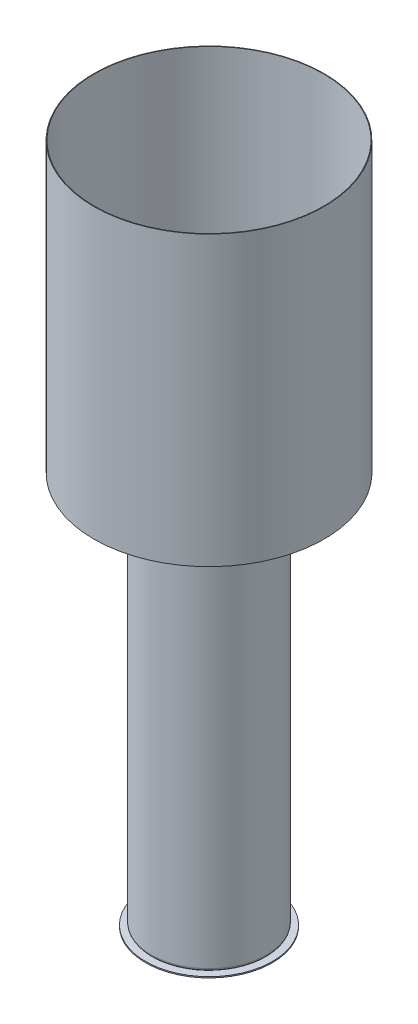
ISO-10303-21;
HEADER;
FILE_DESCRIPTION(('STEP AP214'),'2;1');
FILE_NAME('part.step','',(''),(''),'','','');
FILE_SCHEMA(('AUTOMOTIVE_DESIGN { 1 0 10303 214 1 1 1 1 }'));
ENDSEC;
DATA;
#1=APPLICATION_CONTEXT('core data for automotive mechanical design processes');
#2=APPLICATION_PROTOCOL_DEFINITION('international standard','automotive_design',2000,#1);
#3=PRODUCT_CONTEXT('',#1,'mechanical');
#4=PRODUCT('Part','Part','',(#3));
#5=PRODUCT_RELATED_PRODUCT_CATEGORY('part','',(#4));
#6=PRODUCT_DEFINITION_FORMATION('','',#4);
#7=PRODUCT_DEFINITION_CONTEXT('part definition',#1,'design');
#8=PRODUCT_DEFINITION('design','',#6,#7);
#9=PRODUCT_DEFINITION_SHAPE('','',#8);
#10=(LENGTH_UNIT() NAMED_UNIT(*) SI_UNIT(.MILLI.,.METRE.));
#11=(NAMED_UNIT(*) PLANE_ANGLE_UNIT() SI_UNIT($,.RADIAN.));
#12=(NAMED_UNIT(*) SI_UNIT($,.STERADIAN.) SOLID_ANGLE_UNIT());
#13=UNCERTAINTY_MEASURE_WITH_UNIT(LENGTH_MEASURE(1.E-05),#10,'distance_accuracy_value','');
#14=(GEOMETRIC_REPRESENTATION_CONTEXT(3) GLOBAL_UNCERTAINTY_ASSIGNED_CONTEXT((#13)) GLOBAL_UNIT_ASSIGNED_CONTEXT((#10,
#11,#12)) REPRESENTATION_CONTEXT('',''));
#15=CARTESIAN_POINT('',(0.,0.,0.));
#16=DIRECTION('',(0.,0.,1.));
#17=DIRECTION('',(1.,0.,0.));
#18=AXIS2_PLACEMENT_3D('',#15,#16,#17);
#19=CARTESIAN_POINT('',(0.,-2.,0.));
#20=DIRECTION('',(0.,1.,0.));
#21=DIRECTION('',(0.,0.,1.));
#22=AXIS2_PLACEMENT_3D('',#19,#20,#21);
#23=CYLINDRICAL_SURFACE('',#22,110.);
#24=CARTESIAN_POINT('',(0.,-2.,0.));
#25=DIRECTION('',(0.,-1.,0.));
#26=DIRECTION('',(0.,0.,-1.));
#27=AXIS2_PLACEMENT_3D('',#24,#25,#26);
#28=CIRCLE('',#27,110.);
#29=CARTESIAN_POINT('',(0.,-2.,-110.));
#30=VERTEX_POINT('',#29);
#31=EDGE_CURVE('E11',#30,#30,#28,.T.);
#32=ORIENTED_EDGE('',*,*,#31,.F.);
#33=EDGE_LOOP('',(#32));
#34=FACE_BOUND('',#33,.T.);
#35=CARTESIAN_POINT('',(0.,0.,0.));
#36=DIRECTION('',(0.,-1.,0.));
#37=DIRECTION('',(0.,0.,-1.));
#38=AXIS2_PLACEMENT_3D('',#35,#36,#37);
#39=CIRCLE('',#38,110.);
#40=CARTESIAN_POINT('',(0.,0.,-110.));
#41=VERTEX_POINT('',#40);
#42=EDGE_CURVE('E43',#41,#41,#39,.T.);
#43=ORIENTED_EDGE('',*,*,#42,.T.);
#44=EDGE_LOOP('',(#43));
#45=FACE_BOUND('',#44,.T.);
#46=ADVANCED_FACE('F40',(#34,#45),#23,.T.);
#47=CARTESIAN_POINT('',(0.,-2.,0.));
#48=DIRECTION('',(0.,-1.,0.));
#49=DIRECTION('',(0.,0.,-1.));
#50=AXIS2_PLACEMENT_3D('',#47,#48,#49);
#51=PLANE('',#50);
#52=ORIENTED_EDGE('',*,*,#31,.T.);
#53=EDGE_LOOP('',(#52));
#54=FACE_BOUND('',#53,.T.);
#55=ADVANCED_FACE('F55',(#54),#51,.T.);
#56=CARTESIAN_POINT('',(0.,0.,0.));
#57=DIRECTION('',(0.,-1.,0.));
#58=DIRECTION('',(0.,0.,-1.));
#59=AXIS2_PLACEMENT_3D('',#56,#57,#58);
#60=PLANE('',#59);
#61=ORIENTED_EDGE('',*,*,#42,.F.);
#62=EDGE_LOOP('',(#61));
#63=FACE_BOUND('',#62,.T.);
#64=ADVANCED_FACE('F53',(#63),#60,.F.);
#65=CLOSED_SHELL('',(#46,#55,#64));
#66=MANIFOLD_SOLID_BREP('B2',#65);
#67=CARTESIAN_POINT('',(0.,680.,0.));
#68=DIRECTION('',(0.,1.,0.));
#69=DIRECTION('',(0.,0.,1.));
#70=AXIS2_PLACEMENT_3D('',#67,#68,#69);
#71=CYLINDRICAL_SURFACE('',#70,200.);
#72=CARTESIAN_POINT('',(0.,680.,0.));
#73=DIRECTION('',(0.,1.,0.));
#74=DIRECTION('',(0.,0.,1.));
#75=AXIS2_PLACEMENT_3D('',#72,#73,#74);
#76=CIRCLE('',#75,200.);
#77=CARTESIAN_POINT('',(0.,680.,200.));
#78=VERTEX_POINT('',#77);
#79=EDGE_CURVE('E39',#78,#78,#76,.T.);
#80=ORIENTED_EDGE('',*,*,#79,.T.);
#81=EDGE_LOOP('',(#80));
#82=FACE_BOUND('',#81,.T.);
#83=CARTESIAN_POINT('',(0.,1180.,0.));
#84=DIRECTION('',(0.,1.,0.));
#85=DIRECTION('',(0.,0.,1.));
#86=AXIS2_PLACEMENT_3D('',#83,#84,#85);
#87=CIRCLE('',#86,200.);
#88=CARTESIAN_POINT('',(0.,1180.,200.));
#89=VERTEX_POINT('',#88);
#90=EDGE_CURVE('E98',#89,#89,#87,.T.);
#91=ORIENTED_EDGE('',*,*,#90,.F.);
#92=EDGE_LOOP('',(#91));
#93=FACE_BOUND('',#92,.T.);
#94=ADVANCED_FACE('F88',(#82,#93),#71,.T.);
#95=CARTESIAN_POINT('',(0.,680.,0.));
#96=DIRECTION('',(0.,1.,0.));
#97=DIRECTION('',(0.,0.,1.));
#98=AXIS2_PLACEMENT_3D('',#95,#96,#97);
#99=PLANE('',#98);
#100=CARTESIAN_POINT('',(0.,680.,0.));
#101=DIRECTION('',(0.,1.,0.));
#102=DIRECTION('',(0.,0.,1.));
#103=AXIS2_PLACEMENT_3D('',#100,#101,#102);
#104=CIRCLE('',#103,199.);
#105=CARTESIAN_POINT('',(0.,680.,199.));
#106=VERTEX_POINT('',#105);
#107=EDGE_CURVE('E94',#106,#106,#104,.T.);
#108=ORIENTED_EDGE('',*,*,#107,.T.);
#109=EDGE_LOOP('',(#108));
#110=FACE_BOUND('',#109,.T.);
#111=ORIENTED_EDGE('',*,*,#79,.F.);
#112=EDGE_LOOP('',(#111));
#113=FACE_BOUND('',#112,.T.);
#114=ADVANCED_FACE('F117',(#110,#113),#99,.F.);
#115=CARTESIAN_POINT('',(0.,680.,0.));
#116=DIRECTION('',(0.,1.,0.));
#117=DIRECTION('',(0.,0.,1.));
#118=AXIS2_PLACEMENT_3D('',#115,#116,#117);
#119=CYLINDRICAL_SURFACE('',#118,199.);
#120=ORIENTED_EDGE('',*,*,#107,.F.);
#121=EDGE_LOOP('',(#120));
#122=FACE_BOUND('',#121,.T.);
#123=CARTESIAN_POINT('',(0.,1180.,0.));
#124=DIRECTION('',(0.,1.,0.));
#125=DIRECTION('',(0.,0.,1.));
#126=AXIS2_PLACEMENT_3D('',#123,#124,#125);
#127=CIRCLE('',#126,199.);
#128=CARTESIAN_POINT('',(0.,1180.,199.));
#129=VERTEX_POINT('',#128);
#130=EDGE_CURVE('E102',#129,#129,#127,.T.);
#131=ORIENTED_EDGE('',*,*,#130,.T.);
#132=EDGE_LOOP('',(#131));
#133=FACE_BOUND('',#132,.T.);
#134=ADVANCED_FACE('F108',(#122,#133),#119,.F.);
#135=CARTESIAN_POINT('',(0.,1180.,0.));
#136=DIRECTION('',(0.,1.,0.));
#137=DIRECTION('',(0.,0.,1.));
#138=AXIS2_PLACEMENT_3D('',#135,#136,#137);
#139=PLANE('',#138);
#140=ORIENTED_EDGE('',*,*,#90,.T.);
#141=EDGE_LOOP('',(#140));
#142=FACE_BOUND('',#141,.T.);
#143=ORIENTED_EDGE('',*,*,#130,.F.);
#144=EDGE_LOOP('',(#143));
#145=FACE_BOUND('',#144,.T.);
#146=ADVANCED_FACE('F110',(#142,#145),#139,.T.);
#147=CLOSED_SHELL('',(#94,#114,#134,#146));
#148=MANIFOLD_SOLID_BREP('B6',#147);
#149=CARTESIAN_POINT('',(0.,720.,0.));
#150=DIRECTION('',(0.,-1.,0.));
#151=DIRECTION('',(0.,0.,-1.));
#152=AXIS2_PLACEMENT_3D('',#149,#150,#151);
#153=CYLINDRICAL_SURFACE('',#152,10.);
#154=CARTESIAN_POINT('',(0.,720.,0.));
#155=DIRECTION('',(0.,1.,0.));
#156=DIRECTION('',(0.,0.,1.));
#157=AXIS2_PLACEMENT_3D('',#154,#155,#156);
#158=CIRCLE('',#157,10.);
#159=CARTESIAN_POINT('',(0.,720.,10.));
#160=VERTEX_POINT('',#159);
#161=EDGE_CURVE('E87',#160,#160,#158,.T.);
#162=ORIENTED_EDGE('',*,*,#161,.F.);
#163=EDGE_LOOP('',(#162));
#164=FACE_BOUND('',#163,.T.);
#165=CARTESIAN_POINT('',(0.,700.,0.));
#166=DIRECTION('',(0.,1.,0.));
#167=DIRECTION('',(0.,0.,1.));
#168=AXIS2_PLACEMENT_3D('',#165,#166,#167);
#169=CIRCLE('',#168,10.);
#170=CARTESIAN_POINT('',(0.,700.,10.));
#171=VERTEX_POINT('',#170);
#172=EDGE_CURVE('E159',#171,#171,#169,.T.);
#173=ORIENTED_EDGE('',*,*,#172,.T.);
#174=EDGE_LOOP('',(#173));
#175=FACE_BOUND('',#174,.T.);
#176=ADVANCED_FACE('F156',(#164,#175),#153,.T.);
#177=CARTESIAN_POINT('',(0.,720.,0.));
#178=DIRECTION('',(0.,1.,0.));
#179=DIRECTION('',(0.,0.,1.));
#180=AXIS2_PLACEMENT_3D('',#177,#178,#179);
#181=PLANE('',#180);
#182=ORIENTED_EDGE('',*,*,#161,.T.);
#183=EDGE_LOOP('',(#182));
#184=FACE_BOUND('',#183,.T.);
#185=ADVANCED_FACE('F171',(#184),#181,.T.);
#186=CARTESIAN_POINT('',(0.,700.,0.));
#187=DIRECTION('',(0.,1.,0.));
#188=DIRECTION('',(0.,0.,1.));
#189=AXIS2_PLACEMENT_3D('',#186,#187,#188);
#190=PLANE('',#189);
#191=ORIENTED_EDGE('',*,*,#172,.F.);
#192=EDGE_LOOP('',(#191));
#193=FACE_BOUND('',#192,.T.);
#194=ADVANCED_FACE('F169',(#193),#190,.F.);
#195=CLOSED_SHELL('',(#176,#185,#194));
#196=MANIFOLD_SOLID_BREP('B34',#195);
#197=CARTESIAN_POINT('',(0.,700.,0.));
#198=DIRECTION('',(0.,-1.,0.));
#199=DIRECTION('',(0.,0.,-1.));
#200=AXIS2_PLACEMENT_3D('',#197,#198,#199);
#201=CYLINDRICAL_SURFACE('',#200,100.);
#202=CARTESIAN_POINT('',(0.,5.,0.));
#203=DIRECTION('',(0.,1.,0.));
#204=DIRECTION('',(0.,0.,1.));
#205=AXIS2_PLACEMENT_3D('',#202,#203,#204);
#206=CIRCLE('',#205,100.);
#207=CARTESIAN_POINT('',(0.,5.,100.));
#208=VERTEX_POINT('',#207);
#209=EDGE_CURVE('E203',#208,#208,#206,.T.);
#210=ORIENTED_EDGE('',*,*,#209,.T.);
#211=EDGE_LOOP('',(#210));
#212=FACE_BOUND('',#211,.T.);
#213=CARTESIAN_POINT('',(0.,690.,0.));
#214=DIRECTION('',(0.,1.,0.));
#215=DIRECTION('',(0.,0.,1.));
#216=AXIS2_PLACEMENT_3D('',#213,#214,#215);
#217=CIRCLE('',#216,100.);
#218=CARTESIAN_POINT('',(0.,690.,100.));
#219=VERTEX_POINT('',#218);
#220=EDGE_CURVE('E207',#219,#219,#217,.F.);
#221=ORIENTED_EDGE('',*,*,#220,.T.);
#222=EDGE_LOOP('',(#221));
#223=FACE_BOUND('',#222,.T.);
#224=ADVANCED_FACE('F196',(#212,#223),#201,.T.);
#225=CARTESIAN_POINT('',(0.,700.,0.));
#226=DIRECTION('',(0.,1.,0.));
#227=DIRECTION('',(0.,0.,1.));
#228=AXIS2_PLACEMENT_3D('',#225,#226,#227);
#229=PLANE('',#228);
#230=CARTESIAN_POINT('',(0.,700.,0.));
#231=DIRECTION('',(0.,1.,0.));
#232=DIRECTION('',(0.,0.,1.));
#233=AXIS2_PLACEMENT_3D('',#230,#231,#232);
#234=CIRCLE('',#233,5.);
#235=CARTESIAN_POINT('',(0.,700.,5.));
#236=VERTEX_POINT('',#235);
#237=EDGE_CURVE('E217',#236,#236,#234,.T.);
#238=ORIENTED_EDGE('',*,*,#237,.F.);
#239=EDGE_LOOP('',(#238));
#240=FACE_BOUND('',#239,.T.);
#241=CARTESIAN_POINT('',(0.,700.,0.));
#242=DIRECTION('',(0.,1.,0.));
#243=DIRECTION('',(0.,0.,1.));
#244=AXIS2_PLACEMENT_3D('',#241,#242,#243);
#245=CIRCLE('',#244,90.);
#246=CARTESIAN_POINT('',(0.,700.,90.));
#247=VERTEX_POINT('',#246);
#248=EDGE_CURVE('E211',#247,#247,#245,.T.);
#249=ORIENTED_EDGE('',*,*,#248,.T.);
#250=EDGE_LOOP('',(#249));
#251=FACE_BOUND('',#250,.T.);
#252=ADVANCED_FACE('F232',(#240,#251),#229,.T.);
#253=CARTESIAN_POINT('',(0.,0.,0.));
#254=DIRECTION('',(0.,1.,0.));
#255=DIRECTION('',(0.,0.,1.));
#256=AXIS2_PLACEMENT_3D('',#253,#254,#255);
#257=PLANE('',#256);
#258=CARTESIAN_POINT('',(0.,0.,0.));
#259=DIRECTION('',(0.,1.,0.));
#260=DIRECTION('',(0.,0.,1.));
#261=AXIS2_PLACEMENT_3D('',#258,#259,#260);
#262=CIRCLE('',#261,95.);
#263=CARTESIAN_POINT('',(0.,0.,95.));
#264=VERTEX_POINT('',#263);
#265=EDGE_CURVE('E155',#264,#264,#262,.F.);
#266=ORIENTED_EDGE('',*,*,#265,.T.);
#267=EDGE_LOOP('',(#266));
#268=FACE_BOUND('',#267,.T.);
#269=CARTESIAN_POINT('',(0.,0.,0.));
#270=DIRECTION('',(0.,1.,0.));
#271=DIRECTION('',(0.,0.,1.));
#272=AXIS2_PLACEMENT_3D('',#269,#270,#271);
#273=CIRCLE('',#272,85.);
#274=CARTESIAN_POINT('',(0.,0.,85.));
#275=VERTEX_POINT('',#274);
#276=EDGE_CURVE('E216',#275,#275,#273,.T.);
#277=ORIENTED_EDGE('',*,*,#276,.T.);
#278=EDGE_LOOP('',(#277));
#279=FACE_BOUND('',#278,.T.);
#280=ADVANCED_FACE('F235',(#268,#279),#257,.F.);
#281=CARTESIAN_POINT('',(0.,700.,0.));
#282=DIRECTION('',(0.,-1.,0.));
#283=DIRECTION('',(0.,0.,-1.));
#284=AXIS2_PLACEMENT_3D('',#281,#282,#283);
#285=CYLINDRICAL_SURFACE('',#284,85.);
#286=CARTESIAN_POINT('',(0.,685.,0.));
#287=DIRECTION('',(0.,1.,0.));
#288=DIRECTION('',(0.,0.,1.));
#289=AXIS2_PLACEMENT_3D('',#286,#287,#288);
#290=CIRCLE('',#289,85.);
#291=CARTESIAN_POINT('',(0.,685.,85.));
#292=VERTEX_POINT('',#291);
#293=EDGE_CURVE('E221',#292,#292,#290,.T.);
#294=ORIENTED_EDGE('',*,*,#293,.T.);
#295=EDGE_LOOP('',(#294));
#296=FACE_BOUND('',#295,.T.);
#297=ORIENTED_EDGE('',*,*,#276,.F.);
#298=EDGE_LOOP('',(#297));
#299=FACE_BOUND('',#298,.T.);
#300=ADVANCED_FACE('F248',(#296,#299),#285,.F.);
#301=CARTESIAN_POINT('',(0.,685.,0.));
#302=DIRECTION('',(0.,1.,0.));
#303=DIRECTION('',(0.,0.,1.));
#304=AXIS2_PLACEMENT_3D('',#301,#302,#303);
#305=PLANE('',#304);
#306=CARTESIAN_POINT('',(0.,685.,0.));
#307=DIRECTION('',(0.,1.,0.));
#308=DIRECTION('',(0.,0.,1.));
#309=AXIS2_PLACEMENT_3D('',#306,#307,#308);
#310=CIRCLE('',#309,5.);
#311=CARTESIAN_POINT('',(0.,685.,5.));
#312=VERTEX_POINT('',#311);
#313=EDGE_CURVE('E214',#312,#312,#310,.T.);
#314=ORIENTED_EDGE('',*,*,#313,.T.);
#315=EDGE_LOOP('',(#314));
#316=FACE_BOUND('',#315,.T.);
#317=ORIENTED_EDGE('',*,*,#293,.F.);
#318=EDGE_LOOP('',(#317));
#319=FACE_BOUND('',#318,.T.);
#320=ADVANCED_FACE('F241',(#316,#319),#305,.F.);
#321=CARTESIAN_POINT('',(0.,690.,0.));
#322=DIRECTION('',(0.,1.,0.));
#323=DIRECTION('',(0.,0.,1.));
#324=AXIS2_PLACEMENT_3D('',#321,#322,#323);
#325=TOROIDAL_SURFACE('',#324,90.,10.);
#326=ORIENTED_EDGE('',*,*,#220,.F.);
#327=EDGE_LOOP('',(#326));
#328=FACE_BOUND('',#327,.T.);
#329=ORIENTED_EDGE('',*,*,#248,.F.);
#330=EDGE_LOOP('',(#329));
#331=FACE_BOUND('',#330,.T.);
#332=ADVANCED_FACE('F239',(#328,#331),#325,.T.);
#333=CARTESIAN_POINT('',(0.,100.,0.));
#334=DIRECTION('',(0.,1.,0.));
#335=DIRECTION('',(0.,0.,1.));
#336=AXIS2_PLACEMENT_3D('',#333,#334,#335);
#337=CYLINDRICAL_SURFACE('',#336,5.);
#338=ORIENTED_EDGE('',*,*,#237,.T.);
#339=EDGE_LOOP('',(#338));
#340=FACE_BOUND('',#339,.T.);
#341=ORIENTED_EDGE('',*,*,#313,.F.);
#342=EDGE_LOOP('',(#341));
#343=FACE_BOUND('',#342,.T.);
#344=ADVANCED_FACE('F229',(#340,#343),#337,.F.);
#345=CARTESIAN_POINT('',(0.,5.,0.));
#346=DIRECTION('',(0.,1.,0.));
#347=DIRECTION('',(0.,0.,1.));
#348=AXIS2_PLACEMENT_3D('',#345,#346,#347);
#349=TOROIDAL_SURFACE('',#348,95.,5.);
#350=ORIENTED_EDGE('',*,*,#265,.F.);
#351=EDGE_LOOP('',(#350));
#352=FACE_BOUND('',#351,.T.);
#353=ORIENTED_EDGE('',*,*,#209,.F.);
#354=EDGE_LOOP('',(#353));
#355=FACE_BOUND('',#354,.T.);
#356=ADVANCED_FACE('F198',(#352,#355),#349,.T.);
#357=CLOSED_SHELL('',(#224,#252,#280,#300,#320,#332,#344,#356));
#358=MANIFOLD_SOLID_BREP('B82',#357);
#359=ADVANCED_BREP_SHAPE_REPRESENTATION('',(#18,#66,#148,#196,#358),#14);
#360=SHAPE_DEFINITION_REPRESENTATION(#9,#359);
ENDSEC;
END-ISO-10303-21;
